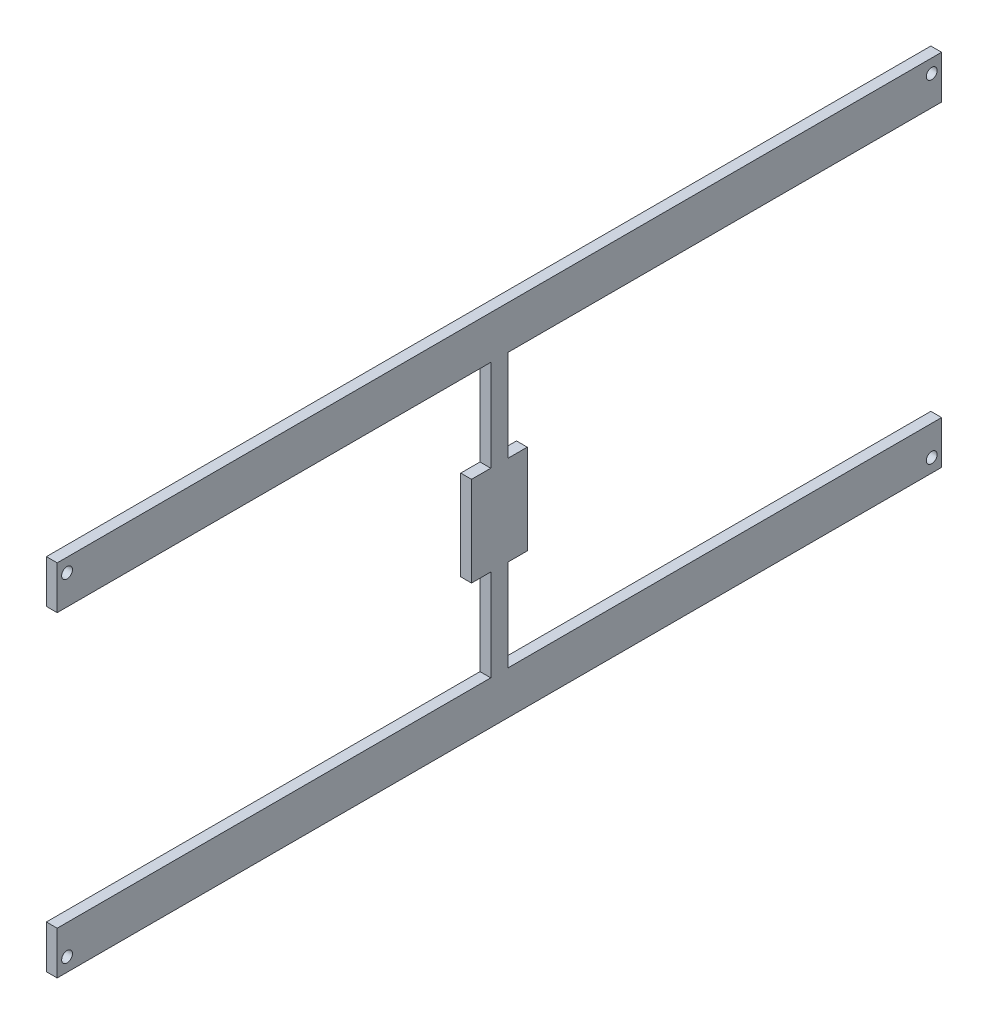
ISO-10303-21;
HEADER;
FILE_DESCRIPTION(('STEP AP214'),'2;1');
FILE_NAME('part.step','',(''),(''),'','','');
FILE_SCHEMA(('AUTOMOTIVE_DESIGN { 1 0 10303 214 1 1 1 1 }'));
ENDSEC;
DATA;
#1=APPLICATION_CONTEXT('core data for automotive mechanical design processes');
#2=APPLICATION_PROTOCOL_DEFINITION('international standard','automotive_design',2000,#1);
#3=PRODUCT_CONTEXT('',#1,'mechanical');
#4=PRODUCT('Part','Part','',(#3));
#5=PRODUCT_RELATED_PRODUCT_CATEGORY('part','',(#4));
#6=PRODUCT_DEFINITION_FORMATION('','',#4);
#7=PRODUCT_DEFINITION_CONTEXT('part definition',#1,'design');
#8=PRODUCT_DEFINITION('design','',#6,#7);
#9=PRODUCT_DEFINITION_SHAPE('','',#8);
#10=(LENGTH_UNIT() NAMED_UNIT(*) SI_UNIT(.MILLI.,.METRE.));
#11=(NAMED_UNIT(*) PLANE_ANGLE_UNIT() SI_UNIT($,.RADIAN.));
#12=(NAMED_UNIT(*) SI_UNIT($,.STERADIAN.) SOLID_ANGLE_UNIT());
#13=UNCERTAINTY_MEASURE_WITH_UNIT(LENGTH_MEASURE(1.E-05),#10,'distance_accuracy_value','');
#14=(GEOMETRIC_REPRESENTATION_CONTEXT(3) GLOBAL_UNCERTAINTY_ASSIGNED_CONTEXT((#13)) GLOBAL_UNIT_ASSIGNED_CONTEXT((#10,
#11,#12)) REPRESENTATION_CONTEXT('',''));
#15=CARTESIAN_POINT('',(0.,0.,0.));
#16=DIRECTION('',(0.,0.,1.));
#17=DIRECTION('',(1.,0.,0.));
#18=AXIS2_PLACEMENT_3D('',#15,#16,#17);
#19=CARTESIAN_POINT('',(3.,0.,0.));
#20=DIRECTION('',(-1.,0.,0.));
#21=DIRECTION('',(0.,0.,1.));
#22=AXIS2_PLACEMENT_3D('',#19,#20,#21);
#23=PLANE('',#22);
#24=CARTESIAN_POINT('',(3.,11.1482954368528,120.25));
#25=DIRECTION('',(1.,0.,0.));
#26=DIRECTION('',(0.,0.,-1.));
#27=AXIS2_PLACEMENT_3D('',#24,#25,#26);
#28=CIRCLE('',#27,1.5);
#29=CARTESIAN_POINT('',(3.,11.1482954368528,118.75));
#30=VERTEX_POINT('',#29);
#31=EDGE_CURVE('E397',#30,#30,#28,.T.);
#32=ORIENTED_EDGE('',*,*,#31,.F.);
#33=EDGE_LOOP('',(#32));
#34=FACE_BOUND('',#33,.T.);
#35=CARTESIAN_POINT('',(3.,11.1482954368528,-120.25));
#36=DIRECTION('',(1.,0.,0.));
#37=DIRECTION('',(0.,0.,-1.));
#38=AXIS2_PLACEMENT_3D('',#35,#36,#37);
#39=CIRCLE('',#38,1.5);
#40=CARTESIAN_POINT('',(3.,11.1482954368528,-121.75));
#41=VERTEX_POINT('',#40);
#42=EDGE_CURVE('E206',#41,#41,#39,.T.);
#43=ORIENTED_EDGE('',*,*,#42,.F.);
#44=EDGE_LOOP('',(#43));
#45=FACE_BOUND('',#44,.T.);
#46=DIRECTION('',(0.,1.,0.));
#47=VECTOR('',#46,1.);
#48=CARTESIAN_POINT('',(3.,14.8982954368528,-123.));
#49=LINE('',#48,#47);
#50=CARTESIAN_POINT('',(3.,2.8982954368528,-123.));
#51=VERTEX_POINT('',#50);
#52=CARTESIAN_POINT('',(3.,14.8982954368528,-123.));
#53=VERTEX_POINT('',#52);
#54=EDGE_CURVE('E242',#51,#53,#49,.T.);
#55=ORIENTED_EDGE('',*,*,#54,.T.);
#56=DIRECTION('',(0.,0.,1.));
#57=VECTOR('',#56,1.);
#58=CARTESIAN_POINT('',(3.,14.8982954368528,-123.));
#59=LINE('',#58,#57);
#60=CARTESIAN_POINT('',(3.,14.8982954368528,123.));
#61=VERTEX_POINT('',#60);
#62=EDGE_CURVE('E129',#53,#61,#59,.T.);
#63=ORIENTED_EDGE('',*,*,#62,.T.);
#64=DIRECTION('',(0.,-1.,0.));
#65=VECTOR('',#64,1.);
#66=CARTESIAN_POINT('',(3.,14.8982954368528,123.));
#67=LINE('',#66,#65);
#68=CARTESIAN_POINT('',(3.,2.8982954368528,123.));
#69=VERTEX_POINT('',#68);
#70=EDGE_CURVE('E293',#61,#69,#67,.T.);
#71=ORIENTED_EDGE('',*,*,#70,.T.);
#72=DIRECTION('',(0.,0.,-1.));
#73=VECTOR('',#72,1.);
#74=CARTESIAN_POINT('',(3.,2.8982954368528,2.40000000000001));
#75=LINE('',#74,#73);
#76=CARTESIAN_POINT('',(3.,2.8982954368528,2.40000000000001));
#77=VERTEX_POINT('',#76);
#78=EDGE_CURVE('E312',#69,#77,#75,.T.);
#79=ORIENTED_EDGE('',*,*,#78,.T.);
#80=DIRECTION('',(0.,-1.,0.));
#81=VECTOR('',#80,1.);
#82=CARTESIAN_POINT('',(3.,2.8982954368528,2.40000000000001));
#83=LINE('',#82,#81);
#84=CARTESIAN_POINT('',(3.,-22.6017045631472,2.40000000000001));
#85=VERTEX_POINT('',#84);
#86=EDGE_CURVE('E309',#77,#85,#83,.T.);
#87=ORIENTED_EDGE('',*,*,#86,.T.);
#88=DIRECTION('',(0.,0.,1.));
#89=VECTOR('',#88,1.);
#90=CARTESIAN_POINT('',(3.,-22.6017045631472,2.40000000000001));
#91=LINE('',#90,#89);
#92=CARTESIAN_POINT('',(3.,-22.6017045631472,7.75));
#93=VERTEX_POINT('',#92);
#94=EDGE_CURVE('E311',#85,#93,#91,.T.);
#95=ORIENTED_EDGE('',*,*,#94,.T.);
#96=DIRECTION('',(0.,-1.,0.));
#97=VECTOR('',#96,1.);
#98=CARTESIAN_POINT('',(3.,-47.6017045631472,7.75));
#99=LINE('',#98,#97);
#100=CARTESIAN_POINT('',(3.,-47.6017045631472,7.75));
#101=VERTEX_POINT('',#100);
#102=EDGE_CURVE('E314',#93,#101,#99,.T.);
#103=ORIENTED_EDGE('',*,*,#102,.T.);
#104=DIRECTION('',(0.,0.,-1.));
#105=VECTOR('',#104,1.);
#106=CARTESIAN_POINT('',(3.,-47.6017045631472,2.40000000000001));
#107=LINE('',#106,#105);
#108=CARTESIAN_POINT('',(3.,-47.6017045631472,2.40000000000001));
#109=VERTEX_POINT('',#108);
#110=EDGE_CURVE('E320',#101,#109,#107,.T.);
#111=ORIENTED_EDGE('',*,*,#110,.T.);
#112=DIRECTION('',(0.,-1.,0.));
#113=VECTOR('',#112,1.);
#114=CARTESIAN_POINT('',(3.,-47.6017045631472,2.40000000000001));
#115=LINE('',#114,#113);
#116=CARTESIAN_POINT('',(3.,-73.1017045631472,2.40000000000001));
#117=VERTEX_POINT('',#116);
#118=EDGE_CURVE('E322',#109,#117,#115,.T.);
#119=ORIENTED_EDGE('',*,*,#118,.T.);
#120=DIRECTION('',(0.,0.,1.));
#121=VECTOR('',#120,1.);
#122=CARTESIAN_POINT('',(3.,-73.1017045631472,2.40000000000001));
#123=LINE('',#122,#121);
#124=CARTESIAN_POINT('',(3.,-73.1017045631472,123.));
#125=VERTEX_POINT('',#124);
#126=EDGE_CURVE('E324',#117,#125,#123,.T.);
#127=ORIENTED_EDGE('',*,*,#126,.T.);
#128=DIRECTION('',(0.,-1.,0.));
#129=VECTOR('',#128,1.);
#130=CARTESIAN_POINT('',(3.,-85.1017045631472,123.));
#131=LINE('',#130,#129);
#132=CARTESIAN_POINT('',(3.,-85.1017045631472,123.));
#133=VERTEX_POINT('',#132);
#134=EDGE_CURVE('E326',#125,#133,#131,.T.);
#135=ORIENTED_EDGE('',*,*,#134,.T.);
#136=DIRECTION('',(0.,0.,-1.));
#137=VECTOR('',#136,1.);
#138=CARTESIAN_POINT('',(3.,-85.1017045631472,-2.4));
#139=LINE('',#138,#137);
#140=CARTESIAN_POINT('',(3.,-85.1017045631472,-123.));
#141=VERTEX_POINT('',#140);
#142=EDGE_CURVE('E328',#133,#141,#139,.T.);
#143=ORIENTED_EDGE('',*,*,#142,.T.);
#144=DIRECTION('',(0.,1.,0.));
#145=VECTOR('',#144,1.);
#146=CARTESIAN_POINT('',(3.,-85.1017045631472,-123.));
#147=LINE('',#146,#145);
#148=CARTESIAN_POINT('',(3.,-73.1017045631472,-123.));
#149=VERTEX_POINT('',#148);
#150=EDGE_CURVE('E330',#141,#149,#147,.T.);
#151=ORIENTED_EDGE('',*,*,#150,.T.);
#152=DIRECTION('',(0.,0.,1.));
#153=VECTOR('',#152,1.);
#154=CARTESIAN_POINT('',(3.,-73.1017045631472,-123.));
#155=LINE('',#154,#153);
#156=CARTESIAN_POINT('',(3.,-73.1017045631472,-2.40000000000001));
#157=VERTEX_POINT('',#156);
#158=EDGE_CURVE('E332',#149,#157,#155,.T.);
#159=ORIENTED_EDGE('',*,*,#158,.T.);
#160=DIRECTION('',(0.,1.,0.));
#161=VECTOR('',#160,1.);
#162=CARTESIAN_POINT('',(3.,-47.6017045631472,-2.40000000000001));
#163=LINE('',#162,#161);
#164=CARTESIAN_POINT('',(3.,-47.6017045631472,-2.40000000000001));
#165=VERTEX_POINT('',#164);
#166=EDGE_CURVE('E334',#157,#165,#163,.T.);
#167=ORIENTED_EDGE('',*,*,#166,.T.);
#168=DIRECTION('',(0.,0.,-1.));
#169=VECTOR('',#168,1.);
#170=CARTESIAN_POINT('',(3.,-47.6017045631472,-7.75));
#171=LINE('',#170,#169);
#172=CARTESIAN_POINT('',(3.,-47.6017045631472,-7.75));
#173=VERTEX_POINT('',#172);
#174=EDGE_CURVE('E336',#165,#173,#171,.T.);
#175=ORIENTED_EDGE('',*,*,#174,.T.);
#176=DIRECTION('',(0.,1.,0.));
#177=VECTOR('',#176,1.);
#178=CARTESIAN_POINT('',(3.,-47.6017045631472,-7.75));
#179=LINE('',#178,#177);
#180=CARTESIAN_POINT('',(3.,-22.6017045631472,-7.75));
#181=VERTEX_POINT('',#180);
#182=EDGE_CURVE('E184',#173,#181,#179,.T.);
#183=ORIENTED_EDGE('',*,*,#182,.T.);
#184=DIRECTION('',(0.,0.,1.));
#185=VECTOR('',#184,1.);
#186=CARTESIAN_POINT('',(3.,-22.6017045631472,-7.75));
#187=LINE('',#186,#185);
#188=CARTESIAN_POINT('',(3.,-22.6017045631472,-2.40000000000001));
#189=VERTEX_POINT('',#188);
#190=EDGE_CURVE('E178',#181,#189,#187,.T.);
#191=ORIENTED_EDGE('',*,*,#190,.T.);
#192=DIRECTION('',(0.,1.,0.));
#193=VECTOR('',#192,1.);
#194=CARTESIAN_POINT('',(3.,2.8982954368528,-2.40000000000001));
#195=LINE('',#194,#193);
#196=CARTESIAN_POINT('',(3.,2.8982954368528,-2.40000000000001));
#197=VERTEX_POINT('',#196);
#198=EDGE_CURVE('E182',#189,#197,#195,.T.);
#199=ORIENTED_EDGE('',*,*,#198,.T.);
#200=DIRECTION('',(0.,0.,-1.));
#201=VECTOR('',#200,1.);
#202=CARTESIAN_POINT('',(3.,2.8982954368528,-123.));
#203=LINE('',#202,#201);
#204=EDGE_CURVE('E50',#197,#51,#203,.T.);
#205=ORIENTED_EDGE('',*,*,#204,.T.);
#206=EDGE_LOOP('',(#55,#63,#71,#79,#87,#95,#103,#111,#119,#127,#135,#143,#151,#159,#167,#175,
#183,#191,#199,#205));
#207=FACE_BOUND('',#206,.T.);
#208=CARTESIAN_POINT('',(3.,-81.3517045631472,-120.25));
#209=DIRECTION('',(1.,0.,0.));
#210=DIRECTION('',(0.,0.,-1.));
#211=AXIS2_PLACEMENT_3D('',#208,#209,#210);
#212=CIRCLE('',#211,1.5);
#213=CARTESIAN_POINT('',(3.,-81.3517045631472,-121.75));
#214=VERTEX_POINT('',#213);
#215=EDGE_CURVE('E403',#214,#214,#212,.T.);
#216=ORIENTED_EDGE('',*,*,#215,.F.);
#217=EDGE_LOOP('',(#216));
#218=FACE_BOUND('',#217,.T.);
#219=CARTESIAN_POINT('',(3.,-81.3517045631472,120.25));
#220=DIRECTION('',(1.,0.,0.));
#221=DIRECTION('',(0.,0.,-1.));
#222=AXIS2_PLACEMENT_3D('',#219,#220,#221);
#223=CIRCLE('',#222,1.5);
#224=CARTESIAN_POINT('',(3.,-81.3517045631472,118.75));
#225=VERTEX_POINT('',#224);
#226=EDGE_CURVE('E388',#225,#225,#223,.T.);
#227=ORIENTED_EDGE('',*,*,#226,.F.);
#228=EDGE_LOOP('',(#227));
#229=FACE_BOUND('',#228,.T.);
#230=ADVANCED_FACE('F33',(#34,#45,#207,#218,#229),#23,.F.);
#231=CARTESIAN_POINT('',(0.,0.,0.));
#232=DIRECTION('',(-1.,0.,0.));
#233=DIRECTION('',(0.,0.,1.));
#234=AXIS2_PLACEMENT_3D('',#231,#232,#233);
#235=PLANE('',#234);
#236=CARTESIAN_POINT('',(0.,11.1482954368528,120.25));
#237=DIRECTION('',(1.,0.,0.));
#238=DIRECTION('',(0.,0.,-1.));
#239=AXIS2_PLACEMENT_3D('',#236,#237,#238);
#240=CIRCLE('',#239,1.5);
#241=CARTESIAN_POINT('',(0.,11.1482954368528,118.75));
#242=VERTEX_POINT('',#241);
#243=EDGE_CURVE('E394',#242,#242,#240,.T.);
#244=ORIENTED_EDGE('',*,*,#243,.T.);
#245=EDGE_LOOP('',(#244));
#246=FACE_BOUND('',#245,.T.);
#247=CARTESIAN_POINT('',(0.,11.1482954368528,-120.25));
#248=DIRECTION('',(1.,0.,0.));
#249=DIRECTION('',(0.,0.,-1.));
#250=AXIS2_PLACEMENT_3D('',#247,#248,#249);
#251=CIRCLE('',#250,1.5);
#252=CARTESIAN_POINT('',(0.,11.1482954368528,-121.75));
#253=VERTEX_POINT('',#252);
#254=EDGE_CURVE('E406',#253,#253,#251,.T.);
#255=ORIENTED_EDGE('',*,*,#254,.T.);
#256=EDGE_LOOP('',(#255));
#257=FACE_BOUND('',#256,.T.);
#258=DIRECTION('',(0.,1.,0.));
#259=VECTOR('',#258,1.);
#260=CARTESIAN_POINT('',(0.,14.8982954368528,-123.));
#261=LINE('',#260,#259);
#262=CARTESIAN_POINT('',(0.,2.8982954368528,-123.));
#263=VERTEX_POINT('',#262);
#264=CARTESIAN_POINT('',(0.,14.8982954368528,-123.));
#265=VERTEX_POINT('',#264);
#266=EDGE_CURVE('E202',#263,#265,#261,.T.);
#267=ORIENTED_EDGE('',*,*,#266,.F.);
#268=DIRECTION('',(0.,0.,-1.));
#269=VECTOR('',#268,1.);
#270=CARTESIAN_POINT('',(0.,2.8982954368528,-123.));
#271=LINE('',#270,#269);
#272=CARTESIAN_POINT('',(0.,2.8982954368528,-2.40000000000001));
#273=VERTEX_POINT('',#272);
#274=EDGE_CURVE('E121',#273,#263,#271,.T.);
#275=ORIENTED_EDGE('',*,*,#274,.F.);
#276=DIRECTION('',(0.,1.,0.));
#277=VECTOR('',#276,1.);
#278=CARTESIAN_POINT('',(0.,2.8982954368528,-2.40000000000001));
#279=LINE('',#278,#277);
#280=CARTESIAN_POINT('',(0.,-22.6017045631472,-2.40000000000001));
#281=VERTEX_POINT('',#280);
#282=EDGE_CURVE('E115',#281,#273,#279,.T.);
#283=ORIENTED_EDGE('',*,*,#282,.F.);
#284=DIRECTION('',(0.,0.,1.));
#285=VECTOR('',#284,1.);
#286=CARTESIAN_POINT('',(0.,-22.6017045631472,-7.75));
#287=LINE('',#286,#285);
#288=CARTESIAN_POINT('',(0.,-22.6017045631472,-7.75));
#289=VERTEX_POINT('',#288);
#290=EDGE_CURVE('E192',#289,#281,#287,.T.);
#291=ORIENTED_EDGE('',*,*,#290,.F.);
#292=DIRECTION('',(0.,1.,0.));
#293=VECTOR('',#292,1.);
#294=CARTESIAN_POINT('',(0.,-47.6017045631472,-7.75));
#295=LINE('',#294,#293);
#296=CARTESIAN_POINT('',(0.,-47.6017045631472,-7.75));
#297=VERTEX_POINT('',#296);
#298=EDGE_CURVE('E237',#297,#289,#295,.T.);
#299=ORIENTED_EDGE('',*,*,#298,.F.);
#300=DIRECTION('',(0.,0.,-1.));
#301=VECTOR('',#300,1.);
#302=CARTESIAN_POINT('',(0.,-47.6017045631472,-7.75));
#303=LINE('',#302,#301);
#304=CARTESIAN_POINT('',(0.,-47.6017045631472,-2.40000000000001));
#305=VERTEX_POINT('',#304);
#306=EDGE_CURVE('E235',#305,#297,#303,.T.);
#307=ORIENTED_EDGE('',*,*,#306,.F.);
#308=DIRECTION('',(0.,1.,0.));
#309=VECTOR('',#308,1.);
#310=CARTESIAN_POINT('',(0.,-47.6017045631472,-2.40000000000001));
#311=LINE('',#310,#309);
#312=CARTESIAN_POINT('',(0.,-73.1017045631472,-2.40000000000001));
#313=VERTEX_POINT('',#312);
#314=EDGE_CURVE('E233',#313,#305,#311,.T.);
#315=ORIENTED_EDGE('',*,*,#314,.F.);
#316=DIRECTION('',(0.,0.,1.));
#317=VECTOR('',#316,1.);
#318=CARTESIAN_POINT('',(0.,-73.1017045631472,-123.));
#319=LINE('',#318,#317);
#320=CARTESIAN_POINT('',(0.,-73.1017045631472,-123.));
#321=VERTEX_POINT('',#320);
#322=EDGE_CURVE('E231',#321,#313,#319,.T.);
#323=ORIENTED_EDGE('',*,*,#322,.F.);
#324=DIRECTION('',(0.,1.,0.));
#325=VECTOR('',#324,1.);
#326=CARTESIAN_POINT('',(0.,-85.1017045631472,-123.));
#327=LINE('',#326,#325);
#328=CARTESIAN_POINT('',(0.,-85.1017045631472,-123.));
#329=VERTEX_POINT('',#328);
#330=EDGE_CURVE('E229',#329,#321,#327,.T.);
#331=ORIENTED_EDGE('',*,*,#330,.F.);
#332=DIRECTION('',(0.,0.,-1.));
#333=VECTOR('',#332,1.);
#334=CARTESIAN_POINT('',(0.,-85.1017045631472,-123.));
#335=LINE('',#334,#333);
#336=CARTESIAN_POINT('',(0.,-85.1017045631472,123.));
#337=VERTEX_POINT('',#336);
#338=EDGE_CURVE('E227',#337,#329,#335,.T.);
#339=ORIENTED_EDGE('',*,*,#338,.F.);
#340=DIRECTION('',(0.,-1.,0.));
#341=VECTOR('',#340,1.);
#342=CARTESIAN_POINT('',(0.,-85.1017045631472,123.));
#343=LINE('',#342,#341);
#344=CARTESIAN_POINT('',(0.,-73.1017045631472,123.));
#345=VERTEX_POINT('',#344);
#346=EDGE_CURVE('E224',#345,#337,#343,.T.);
#347=ORIENTED_EDGE('',*,*,#346,.F.);
#348=DIRECTION('',(0.,0.,1.));
#349=VECTOR('',#348,1.);
#350=CARTESIAN_POINT('',(0.,-73.1017045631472,2.40000000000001));
#351=LINE('',#350,#349);
#352=CARTESIAN_POINT('',(0.,-73.1017045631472,2.40000000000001));
#353=VERTEX_POINT('',#352);
#354=EDGE_CURVE('E222',#353,#345,#351,.T.);
#355=ORIENTED_EDGE('',*,*,#354,.F.);
#356=DIRECTION('',(0.,-1.,0.));
#357=VECTOR('',#356,1.);
#358=CARTESIAN_POINT('',(0.,-47.6017045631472,2.40000000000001));
#359=LINE('',#358,#357);
#360=CARTESIAN_POINT('',(0.,-47.6017045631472,2.40000000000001));
#361=VERTEX_POINT('',#360);
#362=EDGE_CURVE('E220',#361,#353,#359,.T.);
#363=ORIENTED_EDGE('',*,*,#362,.F.);
#364=DIRECTION('',(0.,0.,-1.));
#365=VECTOR('',#364,1.);
#366=CARTESIAN_POINT('',(0.,-47.6017045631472,2.40000000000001));
#367=LINE('',#366,#365);
#368=CARTESIAN_POINT('',(0.,-47.6017045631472,7.75));
#369=VERTEX_POINT('',#368);
#370=EDGE_CURVE('E218',#369,#361,#367,.T.);
#371=ORIENTED_EDGE('',*,*,#370,.F.);
#372=DIRECTION('',(0.,-1.,0.));
#373=VECTOR('',#372,1.);
#374=CARTESIAN_POINT('',(0.,-47.6017045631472,7.75));
#375=LINE('',#374,#373);
#376=CARTESIAN_POINT('',(0.,-22.6017045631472,7.75));
#377=VERTEX_POINT('',#376);
#378=EDGE_CURVE('E216',#377,#369,#375,.T.);
#379=ORIENTED_EDGE('',*,*,#378,.F.);
#380=DIRECTION('',(0.,0.,1.));
#381=VECTOR('',#380,1.);
#382=CARTESIAN_POINT('',(0.,-22.6017045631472,2.40000000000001));
#383=LINE('',#382,#381);
#384=CARTESIAN_POINT('',(0.,-22.6017045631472,2.40000000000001));
#385=VERTEX_POINT('',#384);
#386=EDGE_CURVE('E214',#385,#377,#383,.T.);
#387=ORIENTED_EDGE('',*,*,#386,.F.);
#388=DIRECTION('',(0.,-1.,0.));
#389=VECTOR('',#388,1.);
#390=CARTESIAN_POINT('',(0.,2.8982954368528,2.40000000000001));
#391=LINE('',#390,#389);
#392=CARTESIAN_POINT('',(0.,2.8982954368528,2.40000000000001));
#393=VERTEX_POINT('',#392);
#394=EDGE_CURVE('E212',#393,#385,#391,.T.);
#395=ORIENTED_EDGE('',*,*,#394,.F.);
#396=DIRECTION('',(0.,0.,-1.));
#397=VECTOR('',#396,1.);
#398=CARTESIAN_POINT('',(0.,2.8982954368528,2.40000000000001));
#399=LINE('',#398,#397);
#400=CARTESIAN_POINT('',(0.,2.8982954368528,123.));
#401=VERTEX_POINT('',#400);
#402=EDGE_CURVE('E210',#401,#393,#399,.T.);
#403=ORIENTED_EDGE('',*,*,#402,.F.);
#404=DIRECTION('',(0.,-1.,0.));
#405=VECTOR('',#404,1.);
#406=CARTESIAN_POINT('',(0.,14.8982954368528,123.));
#407=LINE('',#406,#405);
#408=CARTESIAN_POINT('',(0.,14.8982954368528,123.));
#409=VERTEX_POINT('',#408);
#410=EDGE_CURVE('E208',#409,#401,#407,.T.);
#411=ORIENTED_EDGE('',*,*,#410,.F.);
#412=DIRECTION('',(0.,0.,1.));
#413=VECTOR('',#412,1.);
#414=CARTESIAN_POINT('',(0.,14.8982954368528,-2.40000000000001));
#415=LINE('',#414,#413);
#416=EDGE_CURVE('E205',#265,#409,#415,.T.);
#417=ORIENTED_EDGE('',*,*,#416,.F.);
#418=EDGE_LOOP('',(#267,#275,#283,#291,#299,#307,#315,#323,#331,#339,#347,#355,#363,#371,#379,
#387,#395,#403,#411,#417));
#419=FACE_BOUND('',#418,.T.);
#420=CARTESIAN_POINT('',(0.,-81.3517045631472,-120.25));
#421=DIRECTION('',(1.,0.,0.));
#422=DIRECTION('',(0.,0.,-1.));
#423=AXIS2_PLACEMENT_3D('',#420,#421,#422);
#424=CIRCLE('',#423,1.5);
#425=CARTESIAN_POINT('',(0.,-81.3517045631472,-121.75));
#426=VERTEX_POINT('',#425);
#427=EDGE_CURVE('E400',#426,#426,#424,.T.);
#428=ORIENTED_EDGE('',*,*,#427,.T.);
#429=EDGE_LOOP('',(#428));
#430=FACE_BOUND('',#429,.T.);
#431=CARTESIAN_POINT('',(0.,-81.3517045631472,120.25));
#432=DIRECTION('',(1.,0.,0.));
#433=DIRECTION('',(0.,0.,-1.));
#434=AXIS2_PLACEMENT_3D('',#431,#432,#433);
#435=CIRCLE('',#434,1.5);
#436=CARTESIAN_POINT('',(0.,-81.3517045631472,118.75));
#437=VERTEX_POINT('',#436);
#438=EDGE_CURVE('E391',#437,#437,#435,.T.);
#439=ORIENTED_EDGE('',*,*,#438,.T.);
#440=EDGE_LOOP('',(#439));
#441=FACE_BOUND('',#440,.T.);
#442=ADVANCED_FACE('F297',(#246,#257,#419,#430,#441),#235,.T.);
#443=CARTESIAN_POINT('',(3.,14.8982954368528,-123.));
#444=DIRECTION('',(0.,0.,1.));
#445=DIRECTION('',(1.,0.,0.));
#446=AXIS2_PLACEMENT_3D('',#443,#444,#445);
#447=PLANE('',#446);
#448=ORIENTED_EDGE('',*,*,#266,.T.);
#449=DIRECTION('',(-1.,0.,0.));
#450=VECTOR('',#449,1.);
#451=CARTESIAN_POINT('',(3.,14.8982954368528,-123.));
#452=LINE('',#451,#450);
#453=EDGE_CURVE('E11',#53,#265,#452,.T.);
#454=ORIENTED_EDGE('',*,*,#453,.F.);
#455=ORIENTED_EDGE('',*,*,#54,.F.);
#456=DIRECTION('',(-1.,0.,0.));
#457=VECTOR('',#456,1.);
#458=CARTESIAN_POINT('',(3.,2.8982954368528,-123.));
#459=LINE('',#458,#457);
#460=EDGE_CURVE('E198',#51,#263,#459,.T.);
#461=ORIENTED_EDGE('',*,*,#460,.T.);
#462=EDGE_LOOP('',(#448,#454,#455,#461));
#463=FACE_BOUND('',#462,.T.);
#464=ADVANCED_FACE('F35',(#463),#447,.F.);
#465=CARTESIAN_POINT('',(3.,14.8982954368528,-2.40000000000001));
#466=DIRECTION('',(0.,-1.,0.));
#467=DIRECTION('',(0.,0.,-1.));
#468=AXIS2_PLACEMENT_3D('',#465,#466,#467);
#469=PLANE('',#468);
#470=ORIENTED_EDGE('',*,*,#416,.T.);
#471=DIRECTION('',(-1.,0.,0.));
#472=VECTOR('',#471,1.);
#473=CARTESIAN_POINT('',(3.,14.8982954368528,123.));
#474=LINE('',#473,#472);
#475=EDGE_CURVE('E42',#61,#409,#474,.T.);
#476=ORIENTED_EDGE('',*,*,#475,.F.);
#477=ORIENTED_EDGE('',*,*,#62,.F.);
#478=ORIENTED_EDGE('',*,*,#453,.T.);
#479=EDGE_LOOP('',(#470,#476,#477,#478));
#480=FACE_BOUND('',#479,.T.);
#481=ADVANCED_FACE('F596',(#480),#469,.F.);
#482=CARTESIAN_POINT('',(3.,14.8982954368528,123.));
#483=DIRECTION('',(0.,0.,-1.));
#484=DIRECTION('',(-1.,0.,0.));
#485=AXIS2_PLACEMENT_3D('',#482,#483,#484);
#486=PLANE('',#485);
#487=ORIENTED_EDGE('',*,*,#410,.T.);
#488=DIRECTION('',(-1.,0.,0.));
#489=VECTOR('',#488,1.);
#490=CARTESIAN_POINT('',(3.,2.8982954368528,123.));
#491=LINE('',#490,#489);
#492=EDGE_CURVE('E285',#69,#401,#491,.T.);
#493=ORIENTED_EDGE('',*,*,#492,.F.);
#494=ORIENTED_EDGE('',*,*,#70,.F.);
#495=ORIENTED_EDGE('',*,*,#475,.T.);
#496=EDGE_LOOP('',(#487,#493,#494,#495));
#497=FACE_BOUND('',#496,.T.);
#498=ADVANCED_FACE('F291',(#497),#486,.F.);
#499=CARTESIAN_POINT('',(3.,2.8982954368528,2.40000000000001));
#500=DIRECTION('',(0.,1.,0.));
#501=DIRECTION('',(0.,0.,1.));
#502=AXIS2_PLACEMENT_3D('',#499,#500,#501);
#503=PLANE('',#502);
#504=ORIENTED_EDGE('',*,*,#402,.T.);
#505=DIRECTION('',(-1.,0.,0.));
#506=VECTOR('',#505,1.);
#507=CARTESIAN_POINT('',(3.,2.8982954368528,2.40000000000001));
#508=LINE('',#507,#506);
#509=EDGE_CURVE('E282',#77,#393,#508,.T.);
#510=ORIENTED_EDGE('',*,*,#509,.F.);
#511=ORIENTED_EDGE('',*,*,#78,.F.);
#512=ORIENTED_EDGE('',*,*,#492,.T.);
#513=EDGE_LOOP('',(#504,#510,#511,#512));
#514=FACE_BOUND('',#513,.T.);
#515=ADVANCED_FACE('F303',(#514),#503,.F.);
#516=CARTESIAN_POINT('',(3.,2.8982954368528,2.40000000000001));
#517=DIRECTION('',(0.,0.,-1.));
#518=DIRECTION('',(-1.,0.,0.));
#519=AXIS2_PLACEMENT_3D('',#516,#517,#518);
#520=PLANE('',#519);
#521=ORIENTED_EDGE('',*,*,#394,.T.);
#522=DIRECTION('',(-1.,0.,0.));
#523=VECTOR('',#522,1.);
#524=CARTESIAN_POINT('',(3.,-22.6017045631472,2.40000000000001));
#525=LINE('',#524,#523);
#526=EDGE_CURVE('E279',#85,#385,#525,.T.);
#527=ORIENTED_EDGE('',*,*,#526,.F.);
#528=ORIENTED_EDGE('',*,*,#86,.F.);
#529=ORIENTED_EDGE('',*,*,#509,.T.);
#530=EDGE_LOOP('',(#521,#527,#528,#529));
#531=FACE_BOUND('',#530,.T.);
#532=ADVANCED_FACE('F307',(#531),#520,.F.);
#533=CARTESIAN_POINT('',(3.,-22.6017045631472,2.40000000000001));
#534=DIRECTION('',(0.,-1.,0.));
#535=DIRECTION('',(0.,0.,-1.));
#536=AXIS2_PLACEMENT_3D('',#533,#534,#535);
#537=PLANE('',#536);
#538=ORIENTED_EDGE('',*,*,#386,.T.);
#539=DIRECTION('',(-1.,0.,0.));
#540=VECTOR('',#539,1.);
#541=CARTESIAN_POINT('',(3.,-22.6017045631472,7.75));
#542=LINE('',#541,#540);
#543=EDGE_CURVE('E276',#93,#377,#542,.T.);
#544=ORIENTED_EDGE('',*,*,#543,.F.);
#545=ORIENTED_EDGE('',*,*,#94,.F.);
#546=ORIENTED_EDGE('',*,*,#526,.T.);
#547=EDGE_LOOP('',(#538,#544,#545,#546));
#548=FACE_BOUND('',#547,.T.);
#549=ADVANCED_FACE('F561',(#548),#537,.F.);
#550=CARTESIAN_POINT('',(3.,-47.6017045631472,7.75));
#551=DIRECTION('',(0.,0.,-1.));
#552=DIRECTION('',(-1.,0.,0.));
#553=AXIS2_PLACEMENT_3D('',#550,#551,#552);
#554=PLANE('',#553);
#555=ORIENTED_EDGE('',*,*,#378,.T.);
#556=DIRECTION('',(-1.,0.,0.));
#557=VECTOR('',#556,1.);
#558=CARTESIAN_POINT('',(3.,-47.6017045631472,7.75));
#559=LINE('',#558,#557);
#560=EDGE_CURVE('E273',#101,#369,#559,.T.);
#561=ORIENTED_EDGE('',*,*,#560,.F.);
#562=ORIENTED_EDGE('',*,*,#102,.F.);
#563=ORIENTED_EDGE('',*,*,#543,.T.);
#564=EDGE_LOOP('',(#555,#561,#562,#563));
#565=FACE_BOUND('',#564,.T.);
#566=ADVANCED_FACE('F551',(#565),#554,.F.);
#567=CARTESIAN_POINT('',(3.,-47.6017045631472,2.40000000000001));
#568=DIRECTION('',(0.,1.,0.));
#569=DIRECTION('',(0.,0.,1.));
#570=AXIS2_PLACEMENT_3D('',#567,#568,#569);
#571=PLANE('',#570);
#572=ORIENTED_EDGE('',*,*,#370,.T.);
#573=DIRECTION('',(-1.,0.,0.));
#574=VECTOR('',#573,1.);
#575=CARTESIAN_POINT('',(3.,-47.6017045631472,2.40000000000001));
#576=LINE('',#575,#574);
#577=EDGE_CURVE('E270',#109,#361,#576,.T.);
#578=ORIENTED_EDGE('',*,*,#577,.F.);
#579=ORIENTED_EDGE('',*,*,#110,.F.);
#580=ORIENTED_EDGE('',*,*,#560,.T.);
#581=EDGE_LOOP('',(#572,#578,#579,#580));
#582=FACE_BOUND('',#581,.T.);
#583=ADVANCED_FACE('F541',(#582),#571,.F.);
#584=CARTESIAN_POINT('',(3.,-47.6017045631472,2.40000000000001));
#585=DIRECTION('',(0.,0.,-1.));
#586=DIRECTION('',(-1.,0.,0.));
#587=AXIS2_PLACEMENT_3D('',#584,#585,#586);
#588=PLANE('',#587);
#589=ORIENTED_EDGE('',*,*,#362,.T.);
#590=DIRECTION('',(-1.,0.,0.));
#591=VECTOR('',#590,1.);
#592=CARTESIAN_POINT('',(3.,-73.1017045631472,2.40000000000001));
#593=LINE('',#592,#591);
#594=EDGE_CURVE('E267',#117,#353,#593,.T.);
#595=ORIENTED_EDGE('',*,*,#594,.F.);
#596=ORIENTED_EDGE('',*,*,#118,.F.);
#597=ORIENTED_EDGE('',*,*,#577,.T.);
#598=EDGE_LOOP('',(#589,#595,#596,#597));
#599=FACE_BOUND('',#598,.T.);
#600=ADVANCED_FACE('F531',(#599),#588,.F.);
#601=CARTESIAN_POINT('',(3.,-73.1017045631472,2.40000000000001));
#602=DIRECTION('',(0.,-1.,0.));
#603=DIRECTION('',(0.,0.,-1.));
#604=AXIS2_PLACEMENT_3D('',#601,#602,#603);
#605=PLANE('',#604);
#606=ORIENTED_EDGE('',*,*,#354,.T.);
#607=DIRECTION('',(-1.,0.,0.));
#608=VECTOR('',#607,1.);
#609=CARTESIAN_POINT('',(3.,-73.1017045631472,123.));
#610=LINE('',#609,#608);
#611=EDGE_CURVE('E264',#125,#345,#610,.T.);
#612=ORIENTED_EDGE('',*,*,#611,.F.);
#613=ORIENTED_EDGE('',*,*,#126,.F.);
#614=ORIENTED_EDGE('',*,*,#594,.T.);
#615=EDGE_LOOP('',(#606,#612,#613,#614));
#616=FACE_BOUND('',#615,.T.);
#617=ADVANCED_FACE('F521',(#616),#605,.F.);
#618=CARTESIAN_POINT('',(3.,-85.1017045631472,123.));
#619=DIRECTION('',(0.,0.,-1.));
#620=DIRECTION('',(0.,1.,0.));
#621=AXIS2_PLACEMENT_3D('',#618,#619,#620);
#622=PLANE('',#621);
#623=ORIENTED_EDGE('',*,*,#346,.T.);
#624=DIRECTION('',(-1.,0.,0.));
#625=VECTOR('',#624,1.);
#626=CARTESIAN_POINT('',(3.,-85.1017045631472,123.));
#627=LINE('',#626,#625);
#628=EDGE_CURVE('E261',#133,#337,#627,.T.);
#629=ORIENTED_EDGE('',*,*,#628,.F.);
#630=ORIENTED_EDGE('',*,*,#134,.F.);
#631=ORIENTED_EDGE('',*,*,#611,.T.);
#632=EDGE_LOOP('',(#623,#629,#630,#631));
#633=FACE_BOUND('',#632,.T.);
#634=ADVANCED_FACE('F510',(#633),#622,.F.);
#635=CARTESIAN_POINT('',(3.,-85.1017045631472,-123.));
#636=DIRECTION('',(0.,1.,0.));
#637=DIRECTION('',(0.,0.,1.));
#638=AXIS2_PLACEMENT_3D('',#635,#636,#637);
#639=PLANE('',#638);
#640=ORIENTED_EDGE('',*,*,#338,.T.);
#641=DIRECTION('',(-1.,0.,0.));
#642=VECTOR('',#641,1.);
#643=CARTESIAN_POINT('',(3.,-85.1017045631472,-123.));
#644=LINE('',#643,#642);
#645=EDGE_CURVE('E258',#141,#329,#644,.T.);
#646=ORIENTED_EDGE('',*,*,#645,.F.);
#647=ORIENTED_EDGE('',*,*,#142,.F.);
#648=ORIENTED_EDGE('',*,*,#628,.T.);
#649=EDGE_LOOP('',(#640,#646,#647,#648));
#650=FACE_BOUND('',#649,.T.);
#651=ADVANCED_FACE('F500',(#650),#639,.F.);
#652=CARTESIAN_POINT('',(3.,-85.1017045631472,-123.));
#653=DIRECTION('',(0.,0.,1.));
#654=DIRECTION('',(0.,-1.,0.));
#655=AXIS2_PLACEMENT_3D('',#652,#653,#654);
#656=PLANE('',#655);
#657=ORIENTED_EDGE('',*,*,#330,.T.);
#658=DIRECTION('',(-1.,0.,0.));
#659=VECTOR('',#658,1.);
#660=CARTESIAN_POINT('',(3.,-73.1017045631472,-123.));
#661=LINE('',#660,#659);
#662=EDGE_CURVE('E255',#149,#321,#661,.T.);
#663=ORIENTED_EDGE('',*,*,#662,.F.);
#664=ORIENTED_EDGE('',*,*,#150,.F.);
#665=ORIENTED_EDGE('',*,*,#645,.T.);
#666=EDGE_LOOP('',(#657,#663,#664,#665));
#667=FACE_BOUND('',#666,.T.);
#668=ADVANCED_FACE('F490',(#667),#656,.F.);
#669=CARTESIAN_POINT('',(3.,-73.1017045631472,-123.));
#670=DIRECTION('',(0.,-1.,0.));
#671=DIRECTION('',(0.,0.,-1.));
#672=AXIS2_PLACEMENT_3D('',#669,#670,#671);
#673=PLANE('',#672);
#674=ORIENTED_EDGE('',*,*,#322,.T.);
#675=DIRECTION('',(-1.,0.,0.));
#676=VECTOR('',#675,1.);
#677=CARTESIAN_POINT('',(3.,-73.1017045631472,-2.40000000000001));
#678=LINE('',#677,#676);
#679=EDGE_CURVE('E252',#157,#313,#678,.T.);
#680=ORIENTED_EDGE('',*,*,#679,.F.);
#681=ORIENTED_EDGE('',*,*,#158,.F.);
#682=ORIENTED_EDGE('',*,*,#662,.T.);
#683=EDGE_LOOP('',(#674,#680,#681,#682));
#684=FACE_BOUND('',#683,.T.);
#685=ADVANCED_FACE('F480',(#684),#673,.F.);
#686=CARTESIAN_POINT('',(3.,-47.6017045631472,-2.40000000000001));
#687=DIRECTION('',(0.,0.,1.));
#688=DIRECTION('',(1.,0.,0.));
#689=AXIS2_PLACEMENT_3D('',#686,#687,#688);
#690=PLANE('',#689);
#691=ORIENTED_EDGE('',*,*,#314,.T.);
#692=DIRECTION('',(-1.,0.,0.));
#693=VECTOR('',#692,1.);
#694=CARTESIAN_POINT('',(3.,-47.6017045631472,-2.40000000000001));
#695=LINE('',#694,#693);
#696=EDGE_CURVE('E249',#165,#305,#695,.T.);
#697=ORIENTED_EDGE('',*,*,#696,.F.);
#698=ORIENTED_EDGE('',*,*,#166,.F.);
#699=ORIENTED_EDGE('',*,*,#679,.T.);
#700=EDGE_LOOP('',(#691,#697,#698,#699));
#701=FACE_BOUND('',#700,.T.);
#702=ADVANCED_FACE('F471',(#701),#690,.F.);
#703=CARTESIAN_POINT('',(3.,-47.6017045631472,-7.75));
#704=DIRECTION('',(0.,1.,0.));
#705=DIRECTION('',(0.,0.,1.));
#706=AXIS2_PLACEMENT_3D('',#703,#704,#705);
#707=PLANE('',#706);
#708=ORIENTED_EDGE('',*,*,#306,.T.);
#709=DIRECTION('',(-1.,0.,0.));
#710=VECTOR('',#709,1.);
#711=CARTESIAN_POINT('',(3.,-47.6017045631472,-7.75));
#712=LINE('',#711,#710);
#713=EDGE_CURVE('E246',#173,#297,#712,.T.);
#714=ORIENTED_EDGE('',*,*,#713,.F.);
#715=ORIENTED_EDGE('',*,*,#174,.F.);
#716=ORIENTED_EDGE('',*,*,#696,.T.);
#717=EDGE_LOOP('',(#708,#714,#715,#716));
#718=FACE_BOUND('',#717,.T.);
#719=ADVANCED_FACE('F342',(#718),#707,.F.);
#720=CARTESIAN_POINT('',(3.,-47.6017045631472,-7.75));
#721=DIRECTION('',(0.,0.,1.));
#722=DIRECTION('',(1.,0.,0.));
#723=AXIS2_PLACEMENT_3D('',#720,#721,#722);
#724=PLANE('',#723);
#725=ORIENTED_EDGE('',*,*,#298,.T.);
#726=DIRECTION('',(-1.,0.,0.));
#727=VECTOR('',#726,1.);
#728=CARTESIAN_POINT('',(3.,-22.6017045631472,-7.75));
#729=LINE('',#728,#727);
#730=EDGE_CURVE('E193',#181,#289,#729,.T.);
#731=ORIENTED_EDGE('',*,*,#730,.F.);
#732=ORIENTED_EDGE('',*,*,#182,.F.);
#733=ORIENTED_EDGE('',*,*,#713,.T.);
#734=EDGE_LOOP('',(#725,#731,#732,#733));
#735=FACE_BOUND('',#734,.T.);
#736=ADVANCED_FACE('F346',(#735),#724,.F.);
#737=CARTESIAN_POINT('',(3.,-22.6017045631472,-7.75));
#738=DIRECTION('',(0.,-1.,0.));
#739=DIRECTION('',(0.,0.,-1.));
#740=AXIS2_PLACEMENT_3D('',#737,#738,#739);
#741=PLANE('',#740);
#742=ORIENTED_EDGE('',*,*,#290,.T.);
#743=DIRECTION('',(-1.,0.,0.));
#744=VECTOR('',#743,1.);
#745=CARTESIAN_POINT('',(3.,-22.6017045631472,-2.40000000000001));
#746=LINE('',#745,#744);
#747=EDGE_CURVE('E189',#189,#281,#746,.T.);
#748=ORIENTED_EDGE('',*,*,#747,.F.);
#749=ORIENTED_EDGE('',*,*,#190,.F.);
#750=ORIENTED_EDGE('',*,*,#730,.T.);
#751=EDGE_LOOP('',(#742,#748,#749,#750));
#752=FACE_BOUND('',#751,.T.);
#753=ADVANCED_FACE('F190',(#752),#741,.F.);
#754=CARTESIAN_POINT('',(3.,2.8982954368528,-2.40000000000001));
#755=DIRECTION('',(0.,0.,1.));
#756=DIRECTION('',(1.,0.,0.));
#757=AXIS2_PLACEMENT_3D('',#754,#755,#756);
#758=PLANE('',#757);
#759=ORIENTED_EDGE('',*,*,#282,.T.);
#760=DIRECTION('',(-1.,0.,0.));
#761=VECTOR('',#760,1.);
#762=CARTESIAN_POINT('',(3.,2.8982954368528,-2.40000000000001));
#763=LINE('',#762,#761);
#764=EDGE_CURVE('E194',#197,#273,#763,.T.);
#765=ORIENTED_EDGE('',*,*,#764,.F.);
#766=ORIENTED_EDGE('',*,*,#198,.F.);
#767=ORIENTED_EDGE('',*,*,#747,.T.);
#768=EDGE_LOOP('',(#759,#765,#766,#767));
#769=FACE_BOUND('',#768,.T.);
#770=ADVANCED_FACE('F196',(#769),#758,.F.);
#771=CARTESIAN_POINT('',(3.,2.8982954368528,-123.));
#772=DIRECTION('',(0.,1.,0.));
#773=DIRECTION('',(0.,0.,1.));
#774=AXIS2_PLACEMENT_3D('',#771,#772,#773);
#775=PLANE('',#774);
#776=ORIENTED_EDGE('',*,*,#274,.T.);
#777=ORIENTED_EDGE('',*,*,#460,.F.);
#778=ORIENTED_EDGE('',*,*,#204,.F.);
#779=ORIENTED_EDGE('',*,*,#764,.T.);
#780=EDGE_LOOP('',(#776,#777,#778,#779));
#781=FACE_BOUND('',#780,.T.);
#782=ADVANCED_FACE('F350',(#781),#775,.F.);
#783=CARTESIAN_POINT('',(3.,11.1482954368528,-120.25));
#784=DIRECTION('',(-1.,0.,0.));
#785=DIRECTION('',(0.,0.,1.));
#786=AXIS2_PLACEMENT_3D('',#783,#784,#785);
#787=CYLINDRICAL_SURFACE('',#786,1.5);
#788=ORIENTED_EDGE('',*,*,#42,.T.);
#789=EDGE_LOOP('',(#788));
#790=FACE_BOUND('',#789,.T.);
#791=ORIENTED_EDGE('',*,*,#254,.F.);
#792=EDGE_LOOP('',(#791));
#793=FACE_BOUND('',#792,.T.);
#794=ADVANCED_FACE('F352',(#790,#793),#787,.F.);
#795=CARTESIAN_POINT('',(3.,-81.3517045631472,-120.25));
#796=DIRECTION('',(-1.,0.,0.));
#797=DIRECTION('',(0.,0.,1.));
#798=AXIS2_PLACEMENT_3D('',#795,#796,#797);
#799=CYLINDRICAL_SURFACE('',#798,1.5);
#800=ORIENTED_EDGE('',*,*,#215,.T.);
#801=EDGE_LOOP('',(#800));
#802=FACE_BOUND('',#801,.T.);
#803=ORIENTED_EDGE('',*,*,#427,.F.);
#804=EDGE_LOOP('',(#803));
#805=FACE_BOUND('',#804,.T.);
#806=ADVANCED_FACE('F358',(#802,#805),#799,.F.);
#807=CARTESIAN_POINT('',(3.,11.1482954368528,120.25));
#808=DIRECTION('',(-1.,0.,0.));
#809=DIRECTION('',(0.,0.,1.));
#810=AXIS2_PLACEMENT_3D('',#807,#808,#809);
#811=CYLINDRICAL_SURFACE('',#810,1.5);
#812=ORIENTED_EDGE('',*,*,#31,.T.);
#813=EDGE_LOOP('',(#812));
#814=FACE_BOUND('',#813,.T.);
#815=ORIENTED_EDGE('',*,*,#243,.F.);
#816=EDGE_LOOP('',(#815));
#817=FACE_BOUND('',#816,.T.);
#818=ADVANCED_FACE('F375',(#814,#817),#811,.F.);
#819=CARTESIAN_POINT('',(3.,-81.3517045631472,120.25));
#820=DIRECTION('',(-1.,0.,0.));
#821=DIRECTION('',(0.,0.,1.));
#822=AXIS2_PLACEMENT_3D('',#819,#820,#821);
#823=CYLINDRICAL_SURFACE('',#822,1.5);
#824=ORIENTED_EDGE('',*,*,#226,.T.);
#825=EDGE_LOOP('',(#824));
#826=FACE_BOUND('',#825,.T.);
#827=ORIENTED_EDGE('',*,*,#438,.F.);
#828=EDGE_LOOP('',(#827));
#829=FACE_BOUND('',#828,.T.);
#830=ADVANCED_FACE('F379',(#826,#829),#823,.F.);
#831=CLOSED_SHELL('',(#230,#442,#464,#481,#498,#515,#532,#549,#566,#583,#600,#617,#634,#651,
#668,#685,#702,#719,#736,#753,#770,#782,#794,#806,#818,#830));
#832=MANIFOLD_SOLID_BREP('B2',#831);
#833=ADVANCED_BREP_SHAPE_REPRESENTATION('',(#18,#832),#14);
#834=SHAPE_DEFINITION_REPRESENTATION(#9,#833);
ENDSEC;
END-ISO-10303-21;
